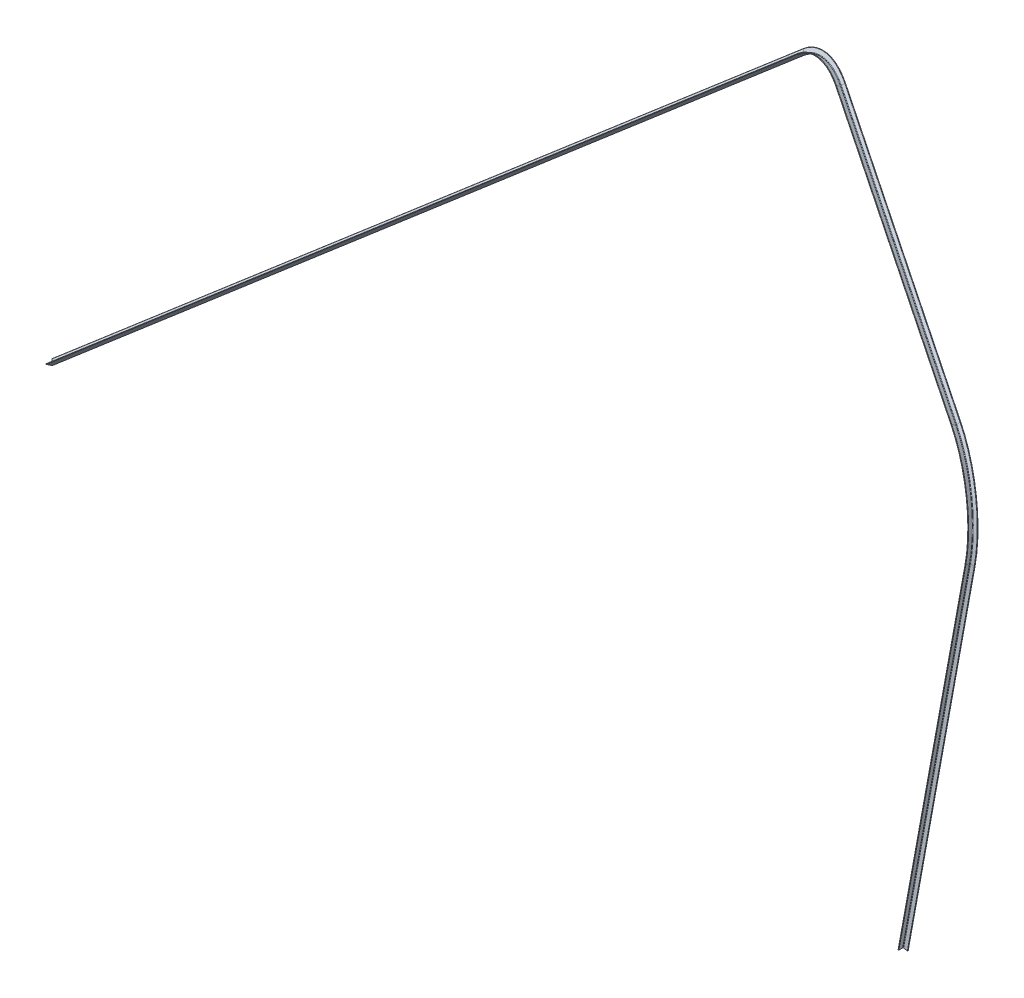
ISO-10303-21;
HEADER;
FILE_DESCRIPTION(('STEP AP214'),'2;1');
FILE_NAME('part.step','',(''),(''),'','','');
FILE_SCHEMA(('AUTOMOTIVE_DESIGN { 1 0 10303 214 1 1 1 1 }'));
ENDSEC;
DATA;
#1=APPLICATION_CONTEXT('core data for automotive mechanical design processes');
#2=APPLICATION_PROTOCOL_DEFINITION('international standard','automotive_design',2000,#1);
#3=PRODUCT_CONTEXT('',#1,'mechanical');
#4=PRODUCT('Part','Part','',(#3));
#5=PRODUCT_RELATED_PRODUCT_CATEGORY('part','',(#4));
#6=PRODUCT_DEFINITION_FORMATION('','',#4);
#7=PRODUCT_DEFINITION_CONTEXT('part definition',#1,'design');
#8=PRODUCT_DEFINITION('design','',#6,#7);
#9=PRODUCT_DEFINITION_SHAPE('','',#8);
#10=(LENGTH_UNIT() NAMED_UNIT(*) SI_UNIT(.MILLI.,.METRE.));
#11=(NAMED_UNIT(*) PLANE_ANGLE_UNIT() SI_UNIT($,.RADIAN.));
#12=(NAMED_UNIT(*) SI_UNIT($,.STERADIAN.) SOLID_ANGLE_UNIT());
#13=UNCERTAINTY_MEASURE_WITH_UNIT(LENGTH_MEASURE(1.E-05),#10,'distance_accuracy_value','');
#14=(GEOMETRIC_REPRESENTATION_CONTEXT(3) GLOBAL_UNCERTAINTY_ASSIGNED_CONTEXT((#13)) GLOBAL_UNIT_ASSIGNED_CONTEXT((#10,
#11,#12)) REPRESENTATION_CONTEXT('',''));
#15=CARTESIAN_POINT('',(0.,0.,0.));
#16=DIRECTION('',(0.,0.,1.));
#17=DIRECTION('',(1.,0.,0.));
#18=AXIS2_PLACEMENT_3D('',#15,#16,#17);
#19=CARTESIAN_POINT('',(2310.6269897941,5591.29434517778,-3397.12289864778));
#20=DIRECTION('',(0.506532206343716,-0.634988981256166,0.583278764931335));
#21=DIRECTION('',(0.,-0.676484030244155,-0.736457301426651));
#22=AXIS2_PLACEMENT_3D('',#19,#20,#21);
#23=PLANE('',#22);
#24=DIRECTION('',(-0.418650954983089,0.41025951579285,0.810196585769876));
#25=VECTOR('',#24,1.);
#26=CARTESIAN_POINT('',(-18525.1233839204,-12502.8674005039,-5001.18391064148));
#27=LINE('',#26,#25);
#28=CARTESIAN_POINT('',(-18525.1233839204,-12502.8674005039,-5001.18391064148));
#29=VERTEX_POINT('',#28);
#30=CARTESIAN_POINT('',(-18528.0539406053,-12499.9955838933,-4995.51253454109));
#31=VERTEX_POINT('',#30);
#32=EDGE_CURVE('E186',#29,#31,#27,.T.);
#33=ORIENTED_EDGE('',*,*,#32,.T.);
#34=DIRECTION('',(-0.75376156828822,-0.65458087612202,-0.0580290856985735));
#35=VECTOR('',#34,1.);
#36=CARTESIAN_POINT('',(2307.69643310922,5594.16616178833,-3391.45152254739));
#37=LINE('',#36,#35);
#38=CARTESIAN_POINT('',(2307.69643310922,5594.16616178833,-3391.45152254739));
#39=VERTEX_POINT('',#38);
#40=EDGE_CURVE('E11',#39,#31,#37,.T.);
#41=ORIENTED_EDGE('',*,*,#40,.F.);
#42=DIRECTION('',(-0.418650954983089,0.41025951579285,0.810196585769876));
#43=VECTOR('',#42,1.);
#44=CARTESIAN_POINT('',(2310.6269897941,5591.29434517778,-3397.12289864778));
#45=LINE('',#44,#43);
#46=CARTESIAN_POINT('',(2310.6269897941,5591.29434517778,-3397.12289864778));
#47=VERTEX_POINT('',#46);
#48=EDGE_CURVE('E246',#47,#39,#45,.T.);
#49=ORIENTED_EDGE('',*,*,#48,.F.);
#50=DIRECTION('',(-0.75376156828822,-0.65458087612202,-0.0580290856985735));
#51=VECTOR('',#50,1.);
#52=CARTESIAN_POINT('',(2310.6269897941,5591.29434517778,-3397.12289864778));
#53=LINE('',#52,#51);
#54=EDGE_CURVE('E202',#47,#29,#53,.T.);
#55=ORIENTED_EDGE('',*,*,#54,.T.);
#56=EDGE_LOOP('',(#33,#41,#49,#55));
#57=FACE_BOUND('',#56,.T.);
#58=ADVANCED_FACE('F37',(#57),#23,.F.);
#59=CARTESIAN_POINT('',(2311.24215855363,5589.72123891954,-3387.36857119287));
#60=DIRECTION('',(-0.75376156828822,-0.65458087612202,-0.0580290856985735));
#61=DIRECTION('',(0.655685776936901,-0.755033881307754,0.));
#62=AXIS2_PLACEMENT_3D('',#59,#60,#61);
#63=CYLINDRICAL_SURFACE('',#62,7.00000000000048);
#64=CARTESIAN_POINT('',(-18524.5082151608,-12504.4405067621,-4991.42958318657));
#65=DIRECTION('',(0.753761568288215,0.654580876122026,0.058029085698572));
#66=DIRECTION('',(0.504773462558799,-0.63326427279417,0.586668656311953));
#67=AXIS2_PLACEMENT_3D('',#64,#65,#66);
#68=CIRCLE('',#67,7.00000000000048);
#69=CARTESIAN_POINT('',(-18527.4387718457,-12501.5686901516,-4985.75820708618));
#70=VERTEX_POINT('',#69);
#71=EDGE_CURVE('E189',#31,#70,#68,.T.);
#72=ORIENTED_EDGE('',*,*,#71,.T.);
#73=DIRECTION('',(-0.75376156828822,-0.65458087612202,-0.0580290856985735));
#74=VECTOR('',#73,1.);
#75=CARTESIAN_POINT('',(2308.31160186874,5592.59305553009,-3381.69719509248));
#76=LINE('',#75,#74);
#77=CARTESIAN_POINT('',(2308.31160186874,5592.59305553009,-3381.69719509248));
#78=VERTEX_POINT('',#77);
#79=EDGE_CURVE('E45',#78,#70,#76,.T.);
#80=ORIENTED_EDGE('',*,*,#79,.F.);
#81=CARTESIAN_POINT('',(2311.24215855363,5589.72123891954,-3387.36857119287));
#82=DIRECTION('',(0.753761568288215,0.654580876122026,0.058029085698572));
#83=DIRECTION('',(0.504773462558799,-0.63326427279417,0.586668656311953));
#84=AXIS2_PLACEMENT_3D('',#81,#82,#83);
#85=CIRCLE('',#84,7.00000000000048);
#86=EDGE_CURVE('E98',#39,#78,#85,.T.);
#87=ORIENTED_EDGE('',*,*,#86,.F.);
#88=ORIENTED_EDGE('',*,*,#40,.T.);
#89=EDGE_LOOP('',(#72,#80,#87,#88));
#90=FACE_BOUND('',#89,.T.);
#91=ADVANCED_FACE('F585',(#90),#63,.T.);
#92=CARTESIAN_POINT('',(2308.31160186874,5592.59305553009,-3381.69719509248));
#93=DIRECTION('',(0.418650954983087,-0.410259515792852,-0.810196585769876));
#94=DIRECTION('',(-0.8884038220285,0.,-0.459062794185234));
#95=AXIS2_PLACEMENT_3D('',#92,#93,#94);
#96=PLANE('',#95);
#97=DIRECTION('',(0.50653220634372,-0.634988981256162,0.583278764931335));
#98=VECTOR('',#97,1.);
#99=CARTESIAN_POINT('',(-18527.4387718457,-12501.5686901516,-4985.75820708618));
#100=LINE('',#99,#98);
#101=CARTESIAN_POINT('',(-18479.3182122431,-12561.8926433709,-4930.34672441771));
#102=VERTEX_POINT('',#101);
#103=EDGE_CURVE('E191',#70,#102,#100,.T.);
#104=ORIENTED_EDGE('',*,*,#103,.T.);
#105=DIRECTION('',(-0.75376156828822,-0.65458087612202,-0.0580290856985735));
#106=VECTOR('',#105,1.);
#107=CARTESIAN_POINT('',(2356.4321614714,5532.26910231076,-3326.28571242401));
#108=LINE('',#107,#106);
#109=CARTESIAN_POINT('',(2356.4321614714,5532.26910231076,-3326.28571242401));
#110=VERTEX_POINT('',#109);
#111=EDGE_CURVE('E210',#110,#102,#108,.T.);
#112=ORIENTED_EDGE('',*,*,#111,.F.);
#113=DIRECTION('',(0.50653220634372,-0.634988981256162,0.583278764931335));
#114=VECTOR('',#113,1.);
#115=CARTESIAN_POINT('',(2308.31160186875,5592.59305553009,-3381.69719509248));
#116=LINE('',#115,#114);
#117=EDGE_CURVE('E218',#78,#110,#116,.T.);
#118=ORIENTED_EDGE('',*,*,#117,.F.);
#119=ORIENTED_EDGE('',*,*,#79,.T.);
#120=EDGE_LOOP('',(#104,#112,#118,#119));
#121=FACE_BOUND('',#120,.T.);
#122=ADVANCED_FACE('F216',(#121),#96,.F.);
#123=CARTESIAN_POINT('',(2350.57104810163,5538.01273553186,-3314.94296022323));
#124=DIRECTION('',(-0.75376156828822,-0.65458087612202,-0.0580290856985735));
#125=DIRECTION('',(0.655685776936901,-0.755033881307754,0.));
#126=AXIS2_PLACEMENT_3D('',#123,#124,#125);
#127=CYLINDRICAL_SURFACE('',#126,14.0000000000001);
#128=CARTESIAN_POINT('',(-18485.1793256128,-12556.1490101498,-4919.00397221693));
#129=DIRECTION('',(-0.753761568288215,-0.654580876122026,-0.058029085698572));
#130=DIRECTION('',(0.504773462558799,-0.63326427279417,0.586668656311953));
#131=AXIS2_PLACEMENT_3D('',#128,#129,#130);
#132=CIRCLE('',#131,14.0000000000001);
#133=CARTESIAN_POINT('',(-18478.087874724,-12565.0388558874,-4910.83806950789));
#134=VERTEX_POINT('',#133);
#135=EDGE_CURVE('E193',#102,#134,#132,.T.);
#136=ORIENTED_EDGE('',*,*,#135,.T.);
#137=DIRECTION('',(-0.75376156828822,-0.65458087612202,-0.0580290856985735));
#138=VECTOR('',#137,1.);
#139=CARTESIAN_POINT('',(2357.66249899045,5529.12288979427,-3306.77705751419));
#140=LINE('',#139,#138);
#141=CARTESIAN_POINT('',(2357.66249899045,5529.12288979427,-3306.77705751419));
#142=VERTEX_POINT('',#141);
#143=EDGE_CURVE('E207',#142,#134,#140,.T.);
#144=ORIENTED_EDGE('',*,*,#143,.F.);
#145=CARTESIAN_POINT('',(2350.57104810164,5538.01273553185,-3314.94296022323));
#146=DIRECTION('',(-0.753761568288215,-0.654580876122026,-0.058029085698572));
#147=DIRECTION('',(0.504773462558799,-0.63326427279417,0.586668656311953));
#148=AXIS2_PLACEMENT_3D('',#145,#146,#147);
#149=CIRCLE('',#148,14.0000000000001);
#150=EDGE_CURVE('E156',#110,#142,#149,.T.);
#151=ORIENTED_EDGE('',*,*,#150,.F.);
#152=ORIENTED_EDGE('',*,*,#111,.T.);
#153=EDGE_LOOP('',(#136,#144,#151,#152));
#154=FACE_BOUND('',#153,.T.);
#155=ADVANCED_FACE('F225',(#154),#127,.F.);
#156=CARTESIAN_POINT('',(2357.66249899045,5529.12288979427,-3306.77705751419));
#157=DIRECTION('',(0.506532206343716,-0.634988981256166,0.583278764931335));
#158=DIRECTION('',(0.,-0.676484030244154,-0.736457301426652));
#159=AXIS2_PLACEMENT_3D('',#156,#157,#158);
#160=PLANE('',#159);
#161=DIRECTION('',(-0.418650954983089,0.41025951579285,0.810196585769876));
#162=VECTOR('',#161,1.);
#163=CARTESIAN_POINT('',(-18478.087874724,-12565.0388558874,-4910.83806950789));
#164=LINE('',#163,#162);
#165=CARTESIAN_POINT('',(-18517.8597154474,-12526.0642018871,-4833.86939385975));
#166=VERTEX_POINT('',#165);
#167=EDGE_CURVE('E195',#134,#166,#164,.T.);
#168=ORIENTED_EDGE('',*,*,#167,.T.);
#169=DIRECTION('',(-0.75376156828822,-0.65458087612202,-0.0580290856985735));
#170=VECTOR('',#169,1.);
#171=CARTESIAN_POINT('',(2317.89065826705,5568.09754379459,-3229.80838186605));
#172=LINE('',#171,#170);
#173=CARTESIAN_POINT('',(2317.89065826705,5568.09754379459,-3229.80838186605));
#174=VERTEX_POINT('',#173);
#175=EDGE_CURVE('E127',#174,#166,#172,.T.);
#176=ORIENTED_EDGE('',*,*,#175,.F.);
#177=DIRECTION('',(-0.418650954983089,0.41025951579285,0.810196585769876));
#178=VECTOR('',#177,1.);
#179=CARTESIAN_POINT('',(2357.66249899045,5529.12288979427,-3306.77705751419));
#180=LINE('',#179,#178);
#181=EDGE_CURVE('E154',#142,#174,#180,.T.);
#182=ORIENTED_EDGE('',*,*,#181,.F.);
#183=ORIENTED_EDGE('',*,*,#143,.T.);
#184=EDGE_LOOP('',(#168,#176,#182,#183));
#185=FACE_BOUND('',#184,.T.);
#186=ADVANCED_FACE('F229',(#185),#160,.F.);
#187=CARTESIAN_POINT('',(2321.43638371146,5563.6526209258,-3225.72543051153));
#188=DIRECTION('',(-0.75376156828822,-0.65458087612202,-0.0580290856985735));
#189=DIRECTION('',(0.655685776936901,-0.755033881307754,0.));
#190=AXIS2_PLACEMENT_3D('',#187,#188,#189);
#191=CYLINDRICAL_SURFACE('',#190,7.00000000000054);
#192=CARTESIAN_POINT('',(-18514.313990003,-12530.5091247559,-4829.78644250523));
#193=DIRECTION('',(0.753761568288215,0.654580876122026,0.058029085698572));
#194=DIRECTION('',(-0.504773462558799,0.63326427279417,-0.586668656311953));
#195=AXIS2_PLACEMENT_3D('',#192,#193,#194);
#196=CIRCLE('',#195,7.00000000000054);
#197=CARTESIAN_POINT('',(-18517.2445466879,-12527.6373081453,-4824.11506640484));
#198=VERTEX_POINT('',#197);
#199=EDGE_CURVE('E124',#166,#198,#196,.T.);
#200=ORIENTED_EDGE('',*,*,#199,.T.);
#201=DIRECTION('',(-0.75376156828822,-0.65458087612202,-0.0580290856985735));
#202=VECTOR('',#201,1.);
#203=CARTESIAN_POINT('',(2318.50582702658,5566.52443753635,-3220.05405441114));
#204=LINE('',#203,#202);
#205=CARTESIAN_POINT('',(2318.50582702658,5566.52443753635,-3220.05405441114));
#206=VERTEX_POINT('',#205);
#207=EDGE_CURVE('E116',#206,#198,#204,.T.);
#208=ORIENTED_EDGE('',*,*,#207,.F.);
#209=CARTESIAN_POINT('',(2321.43638371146,5563.65262092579,-3225.72543051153));
#210=DIRECTION('',(0.753761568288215,0.654580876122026,0.058029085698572));
#211=DIRECTION('',(-0.504773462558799,0.63326427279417,-0.586668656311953));
#212=AXIS2_PLACEMENT_3D('',#209,#210,#211);
#213=CIRCLE('',#212,7.00000000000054);
#214=EDGE_CURVE('E121',#174,#206,#213,.T.);
#215=ORIENTED_EDGE('',*,*,#214,.F.);
#216=ORIENTED_EDGE('',*,*,#175,.T.);
#217=EDGE_LOOP('',(#200,#208,#215,#216));
#218=FACE_BOUND('',#217,.T.);
#219=ADVANCED_FACE('F118',(#218),#191,.T.);
#220=CARTESIAN_POINT('',(2318.50582702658,5566.52443753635,-3220.05405441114));
#221=DIRECTION('',(0.418650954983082,-0.410259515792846,-0.810196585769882));
#222=DIRECTION('',(-0.888403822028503,0.,-0.459062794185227));
#223=AXIS2_PLACEMENT_3D('',#220,#221,#222);
#224=PLANE('',#223);
#225=DIRECTION('',(0.506532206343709,-0.634988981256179,0.583278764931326));
#226=VECTOR('',#225,1.);
#227=CARTESIAN_POINT('',(-18517.2445466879,-12527.6373081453,-4824.11506640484));
#228=LINE('',#227,#226);
#229=CARTESIAN_POINT('',(-18513.6988212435,-12532.0822310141,-4820.03211505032));
#230=VERTEX_POINT('',#229);
#231=EDGE_CURVE('E198',#198,#230,#228,.T.);
#232=ORIENTED_EDGE('',*,*,#231,.T.);
#233=DIRECTION('',(-0.75376156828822,-0.65458087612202,-0.0580290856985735));
#234=VECTOR('',#233,1.);
#235=CARTESIAN_POINT('',(2322.05155247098,5562.07951466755,-3215.97110305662));
#236=LINE('',#235,#234);
#237=CARTESIAN_POINT('',(2322.05155247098,5562.07951466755,-3215.97110305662));
#238=VERTEX_POINT('',#237);
#239=EDGE_CURVE('E128',#238,#230,#236,.T.);
#240=ORIENTED_EDGE('',*,*,#239,.F.);
#241=DIRECTION('',(0.506532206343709,-0.634988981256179,0.583278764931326));
#242=VECTOR('',#241,1.);
#243=CARTESIAN_POINT('',(2318.50582702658,5566.52443753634,-3220.05405441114));
#244=LINE('',#243,#242);
#245=EDGE_CURVE('E131',#206,#238,#244,.T.);
#246=ORIENTED_EDGE('',*,*,#245,.F.);
#247=ORIENTED_EDGE('',*,*,#207,.T.);
#248=EDGE_LOOP('',(#232,#240,#246,#247));
#249=FACE_BOUND('',#248,.T.);
#250=ADVANCED_FACE('F133',(#249),#224,.F.);
#251=CARTESIAN_POINT('',(2376.47617661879,5508.74577761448,-3321.29665920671));
#252=DIRECTION('',(-0.506532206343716,0.634988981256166,-0.583278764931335));
#253=DIRECTION('',(0.,0.676484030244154,0.736457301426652));
#254=AXIS2_PLACEMENT_3D('',#251,#252,#253);
#255=PLANE('',#254);
#256=DIRECTION('',(0.41865095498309,-0.41025951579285,-0.810196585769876));
#257=VECTOR('',#256,1.);
#258=CARTESIAN_POINT('',(-18459.2741970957,-12585.4159680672,-4925.35767120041));
#259=LINE('',#258,#257);
#260=CARTESIAN_POINT('',(-18459.2741970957,-12585.4159680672,-4925.35767120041));
#261=VERTEX_POINT('',#260);
#262=EDGE_CURVE('E84',#230,#261,#259,.T.);
#263=ORIENTED_EDGE('',*,*,#262,.T.);
#264=DIRECTION('',(-0.75376156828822,-0.65458087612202,-0.0580290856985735));
#265=VECTOR('',#264,1.);
#266=CARTESIAN_POINT('',(2376.47617661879,5508.74577761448,-3321.29665920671));
#267=LINE('',#266,#265);
#268=CARTESIAN_POINT('',(2376.47617661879,5508.74577761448,-3321.29665920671));
#269=VERTEX_POINT('',#268);
#270=EDGE_CURVE('E53',#269,#261,#267,.T.);
#271=ORIENTED_EDGE('',*,*,#270,.F.);
#272=DIRECTION('',(0.41865095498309,-0.41025951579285,-0.810196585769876));
#273=VECTOR('',#272,1.);
#274=CARTESIAN_POINT('',(2376.47617661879,5508.74577761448,-3321.29665920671));
#275=LINE('',#274,#273);
#276=EDGE_CURVE('E136',#238,#269,#275,.T.);
#277=ORIENTED_EDGE('',*,*,#276,.F.);
#278=ORIENTED_EDGE('',*,*,#239,.T.);
#279=EDGE_LOOP('',(#263,#271,#277,#278));
#280=FACE_BOUND('',#279,.T.);
#281=ADVANCED_FACE('F575',(#280),#255,.F.);
#282=CARTESIAN_POINT('',(2310.6269897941,5591.29434517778,-3397.12289864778));
#283=DIRECTION('',(-0.418650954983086,0.410259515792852,0.810196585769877));
#284=DIRECTION('',(0.8884038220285,0.,0.459062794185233));
#285=AXIS2_PLACEMENT_3D('',#282,#283,#284);
#286=PLANE('',#285);
#287=DIRECTION('',(-0.506532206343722,0.634988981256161,-0.583278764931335));
#288=VECTOR('',#287,1.);
#289=CARTESIAN_POINT('',(-18525.1233839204,-12502.8674005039,-5001.18391064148));
#290=LINE('',#289,#288);
#291=EDGE_CURVE('E90',#261,#29,#290,.T.);
#292=ORIENTED_EDGE('',*,*,#291,.T.);
#293=ORIENTED_EDGE('',*,*,#54,.F.);
#294=DIRECTION('',(-0.506532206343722,0.634988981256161,-0.583278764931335));
#295=VECTOR('',#294,1.);
#296=CARTESIAN_POINT('',(2310.6269897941,5591.29434517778,-3397.12289864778));
#297=LINE('',#296,#295);
#298=EDGE_CURVE('E162',#269,#47,#297,.T.);
#299=ORIENTED_EDGE('',*,*,#298,.F.);
#300=ORIENTED_EDGE('',*,*,#270,.T.);
#301=EDGE_LOOP('',(#292,#293,#299,#300));
#302=FACE_BOUND('',#301,.T.);
#303=ADVANCED_FACE('F574',(#302),#286,.F.);
#304=CARTESIAN_POINT('',(-18524.5082151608,-12504.4405067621,-4991.42958318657));
#305=DIRECTION('',(-0.753761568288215,-0.654580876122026,-0.058029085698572));
#306=DIRECTION('',(0.504773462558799,-0.63326427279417,0.586668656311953));
#307=AXIS2_PLACEMENT_3D('',#304,#305,#306);
#308=PLANE('',#307);
#309=ORIENTED_EDGE('',*,*,#32,.F.);
#310=ORIENTED_EDGE('',*,*,#291,.F.);
#311=ORIENTED_EDGE('',*,*,#262,.F.);
#312=ORIENTED_EDGE('',*,*,#231,.F.);
#313=ORIENTED_EDGE('',*,*,#199,.F.);
#314=ORIENTED_EDGE('',*,*,#167,.F.);
#315=ORIENTED_EDGE('',*,*,#135,.F.);
#316=ORIENTED_EDGE('',*,*,#103,.F.);
#317=ORIENTED_EDGE('',*,*,#71,.F.);
#318=EDGE_LOOP('',(#309,#310,#311,#312,#313,#314,#315,#316,#317));
#319=FACE_BOUND('',#318,.T.);
#320=ADVANCED_FACE('F222',(#319),#308,.T.);
#321=CARTESIAN_POINT('',(3106.22054861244,4626.92118473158,-2853.04436839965));
#322=DIRECTION('',(-0.302250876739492,0.266923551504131,0.91509356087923));
#323=DIRECTION('',(0.949545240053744,0.,0.313630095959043));
#324=AXIS2_PLACEMENT_3D('',#321,#322,#323);
#325=CONICAL_SURFACE('',#324,1363.45375810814,0.212762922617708);
#326=CARTESIAN_POINT('',(3106.22054861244,4626.92118473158,-2853.04436839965));
#327=DIRECTION('',(-0.302250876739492,0.266923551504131,0.91509356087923));
#328=DIRECTION('',(0.949545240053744,0.,0.313630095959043));
#329=AXIS2_PLACEMENT_3D('',#326,#327,#328);
#330=CIRCLE('',#329,1363.45375810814);
#331=CARTESIAN_POINT('',(3802.82671329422,5793.79078006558,-2963.32287633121));
#332=VERTEX_POINT('',#331);
#333=EDGE_CURVE('E183',#332,#47,#330,.T.);
#334=ORIENTED_EDGE('',*,*,#333,.T.);
#335=ORIENTED_EDGE('',*,*,#48,.T.);
#336=CARTESIAN_POINT('',(3104.15250018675,4628.74751799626,-2846.78315315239));
#337=DIRECTION('',(-0.302250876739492,0.266923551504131,0.91509356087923));
#338=DIRECTION('',(0.949545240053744,0.,0.313630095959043));
#339=AXIS2_PLACEMENT_3D('',#336,#337,#338);
#340=CIRCLE('',#339,1364.93188737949);
#341=CARTESIAN_POINT('',(3801.51386023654,5796.8821244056,-2957.18121474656));
#342=VERTEX_POINT('',#341);
#343=EDGE_CURVE('E165',#342,#39,#340,.T.);
#344=ORIENTED_EDGE('',*,*,#343,.F.);
#345=DIRECTION('',(-0.187550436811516,0.441620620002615,0.877380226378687));
#346=VECTOR('',#345,1.);
#347=CARTESIAN_POINT('',(3802.82671329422,5793.79078006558,-2963.32287633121));
#348=LINE('',#347,#346);
#349=EDGE_CURVE('E294',#332,#342,#348,.T.);
#350=ORIENTED_EDGE('',*,*,#349,.F.);
#351=EDGE_LOOP('',(#334,#335,#344,#350));
#352=FACE_BOUND('',#351,.T.);
#353=ADVANCED_FACE('F572',(#352),#325,.T.);
#354=CARTESIAN_POINT('',(3097.92346820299,4634.24849571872,-2827.92416051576));
#355=DIRECTION('',(0.302250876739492,-0.266923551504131,-0.91509356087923));
#356=DIRECTION('',(-0.949545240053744,0.,-0.313630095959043));
#357=AXIS2_PLACEMENT_3D('',#354,#355,#356);
#358=CONICAL_SURFACE('',#357,1236.38509900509,1.35803340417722);
#359=CARTESIAN_POINT('',(3097.92346820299,4634.24849571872,-2827.92416051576));
#360=DIRECTION('',(-0.302250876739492,0.266923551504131,0.91509356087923));
#361=DIRECTION('',(0.949545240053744,0.,0.313630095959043));
#362=AXIS2_PLACEMENT_3D('',#359,#360,#361);
#363=CIRCLE('',#362,1236.38509900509);
#364=CARTESIAN_POINT('',(3729.60861099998,5692.37032168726,-2927.9251346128));
#365=VERTEX_POINT('',#364);
#366=EDGE_CURVE('E180',#365,#269,#363,.T.);
#367=ORIENTED_EDGE('',*,*,#366,.T.);
#368=ORIENTED_EDGE('',*,*,#298,.T.);
#369=ORIENTED_EDGE('',*,*,#333,.F.);
#370=DIRECTION('',(0.563216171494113,0.780157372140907,-0.272290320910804));
#371=VECTOR('',#370,1.);
#372=CARTESIAN_POINT('',(3802.82671329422,5793.79078006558,-2963.32287633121));
#373=LINE('',#372,#371);
#374=EDGE_CURVE('E276',#365,#332,#373,.T.);
#375=ORIENTED_EDGE('',*,*,#374,.F.);
#376=EDGE_LOOP('',(#367,#368,#369,#375));
#377=FACE_BOUND('',#376,.T.);
#378=ADVANCED_FACE('F529',(#377),#358,.F.);
#379=CARTESIAN_POINT('',(3059.51685458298,4668.16611349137,-2711.644448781));
#380=DIRECTION('',(-0.302250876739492,0.266923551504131,0.91509356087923));
#381=DIRECTION('',(0.949545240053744,0.,0.313630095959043));
#382=AXIS2_PLACEMENT_3D('',#379,#380,#381);
#383=CONICAL_SURFACE('',#382,1263.83607118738,0.212762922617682);
#384=CARTESIAN_POINT('',(3059.51685458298,4668.16611349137,-2711.644448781));
#385=DIRECTION('',(-0.302250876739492,0.266923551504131,0.91509356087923));
#386=DIRECTION('',(0.949545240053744,0.,0.313630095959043));
#387=AXIS2_PLACEMENT_3D('',#384,#385,#386);
#388=CIRCLE('',#387,1263.83607118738);
#389=CARTESIAN_POINT('',(3705.22705421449,5749.7810022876,-2813.86570518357));
#390=VERTEX_POINT('',#389);
#391=EDGE_CURVE('E148',#390,#238,#388,.T.);
#392=ORIENTED_EDGE('',*,*,#391,.T.);
#393=ORIENTED_EDGE('',*,*,#276,.T.);
#394=ORIENTED_EDGE('',*,*,#366,.F.);
#395=DIRECTION('',(0.187550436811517,-0.441620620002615,-0.877380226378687));
#396=VECTOR('',#395,1.);
#397=CARTESIAN_POINT('',(3729.60861099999,5692.37032168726,-2927.9251346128));
#398=LINE('',#397,#396);
#399=EDGE_CURVE('E279',#390,#365,#398,.T.);
#400=ORIENTED_EDGE('',*,*,#399,.F.);
#401=EDGE_LOOP('',(#392,#393,#394,#400));
#402=FACE_BOUND('',#401,.T.);
#403=ADVANCED_FACE('F526',(#402),#383,.F.);
#404=CARTESIAN_POINT('',(3059.96362045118,4667.77156597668,-2712.99707535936));
#405=DIRECTION('',(0.302250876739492,-0.266923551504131,-0.91509356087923));
#406=DIRECTION('',(-0.949545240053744,0.,-0.313630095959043));
#407=AXIS2_PLACEMENT_3D('',#404,#405,#406);
#408=CONICAL_SURFACE('',#407,1270.67822975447,1.35803340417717);
#409=CARTESIAN_POINT('',(3059.96362045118,4667.77156597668,-2712.99707535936));
#410=DIRECTION('',(-0.302250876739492,0.266923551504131,0.91509356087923));
#411=DIRECTION('',(0.949545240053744,0.,0.313630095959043));
#412=AXIS2_PLACEMENT_3D('',#409,#410,#411);
#413=CIRCLE('',#412,1270.67822975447);
#414=CARTESIAN_POINT('',(3709.16956741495,5755.24210389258,-2815.77173742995));
#415=VERTEX_POINT('',#414);
#416=EDGE_CURVE('E140',#415,#206,#413,.T.);
#417=ORIENTED_EDGE('',*,*,#416,.T.);
#418=ORIENTED_EDGE('',*,*,#245,.T.);
#419=ORIENTED_EDGE('',*,*,#391,.F.);
#420=DIRECTION('',(-0.56321617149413,-0.780157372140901,0.272290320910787));
#421=VECTOR('',#420,1.);
#422=CARTESIAN_POINT('',(3709.16956741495,5755.24210389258,-2815.77173742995));
#423=LINE('',#422,#421);
#424=EDGE_CURVE('E144',#415,#390,#423,.T.);
#425=ORIENTED_EDGE('',*,*,#424,.F.);
#426=EDGE_LOOP('',(#417,#418,#419,#425));
#427=FACE_BOUND('',#426,.T.);
#428=ADVANCED_FACE('F141',(#427),#408,.T.);
#429=CARTESIAN_POINT('',(3062.03166887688,4665.945232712,-2719.25829060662));
#430=DIRECTION('',(-0.302250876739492,0.266923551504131,0.91509356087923));
#431=DIRECTION('',(0.949545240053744,0.,0.313630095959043));
#432=AXIS2_PLACEMENT_3D('',#429,#430,#431);
#433=TOROIDAL_SURFACE('',#432,1269.20010048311,7.00000000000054);
#434=CARTESIAN_POINT('',(3062.47843474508,4665.55068519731,-2720.61091718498));
#435=DIRECTION('',(-0.302250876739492,0.266923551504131,0.91509356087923));
#436=DIRECTION('',(0.949545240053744,0.,0.313630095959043));
#437=AXIS2_PLACEMENT_3D('',#434,#435,#436);
#438=CIRCLE('',#437,1276.0422590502);
#439=CARTESIAN_POINT('',(3714.42493367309,5757.61186115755,-2823.81943126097));
#440=VERTEX_POINT('',#439);
#441=EDGE_CURVE('E149',#440,#174,#438,.T.);
#442=ORIENTED_EDGE('',*,*,#441,.T.);
#443=ORIENTED_EDGE('',*,*,#214,.T.);
#444=ORIENTED_EDGE('',*,*,#416,.F.);
#445=CARTESIAN_POINT('',(3710.48242047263,5752.15075955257,-2821.9133990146));
#446=DIRECTION('',(0.80474367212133,-0.443086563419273,0.395046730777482));
#447=DIRECTION('',(0.563997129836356,0.778299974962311,-0.275964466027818));
#448=AXIS2_PLACEMENT_3D('',#445,#446,#447);
#449=CIRCLE('',#448,7.00000000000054);
#450=EDGE_CURVE('E283',#440,#415,#449,.T.);
#451=ORIENTED_EDGE('',*,*,#450,.F.);
#452=EDGE_LOOP('',(#442,#443,#444,#451));
#453=FACE_BOUND('',#452,.T.);
#454=ADVANCED_FACE('F151',(#453),#433,.T.);
#455=CARTESIAN_POINT('',(3090.54480623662,4640.76473374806,-2805.58455268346));
#456=DIRECTION('',(-0.302250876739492,0.266923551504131,0.91509356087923));
#457=DIRECTION('',(0.949545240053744,0.,0.313630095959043));
#458=AXIS2_PLACEMENT_3D('',#455,#456,#457);
#459=CONICAL_SURFACE('',#458,1255.98193322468,0.212762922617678);
#460=CARTESIAN_POINT('',(3090.54480623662,4640.76473374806,-2805.58455268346));
#461=DIRECTION('',(-0.302250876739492,0.266923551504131,0.91509356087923));
#462=DIRECTION('',(0.949545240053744,0.,0.313630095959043));
#463=AXIS2_PLACEMENT_3D('',#460,#461,#462);
#464=CIRCLE('',#463,1255.98193322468);
#465=CARTESIAN_POINT('',(3732.24222517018,5715.65790225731,-2907.17055276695));
#466=VERTEX_POINT('',#465);
#467=EDGE_CURVE('E174',#466,#142,#464,.T.);
#468=ORIENTED_EDGE('',*,*,#467,.T.);
#469=ORIENTED_EDGE('',*,*,#181,.T.);
#470=ORIENTED_EDGE('',*,*,#441,.F.);
#471=DIRECTION('',(-0.187550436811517,0.441620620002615,0.877380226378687));
#472=VECTOR('',#471,1.);
#473=CARTESIAN_POINT('',(3732.24222517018,5715.65790225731,-2907.17055276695));
#474=LINE('',#473,#472);
#475=EDGE_CURVE('E237',#466,#440,#474,.T.);
#476=ORIENTED_EDGE('',*,*,#475,.F.);
#477=EDGE_LOOP('',(#468,#469,#470,#476));
#478=FACE_BOUND('',#477,.T.);
#479=ADVANCED_FACE('F234',(#478),#459,.T.);
#480=CARTESIAN_POINT('',(3091.43833797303,4639.97563871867,-2808.28980584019));
#481=DIRECTION('',(-0.302250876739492,0.266923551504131,0.91509356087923));
#482=DIRECTION('',(0.949545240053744,0.,0.313630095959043));
#483=AXIS2_PLACEMENT_3D('',#480,#481,#482);
#484=TOROIDAL_SURFACE('',#483,1269.66625035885,14.0000000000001);
#485=CARTESIAN_POINT('',(3095.57443482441,4636.32297218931,-2820.8122363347));
#486=DIRECTION('',(-0.302250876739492,0.266923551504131,0.91509356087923));
#487=DIRECTION('',(0.949545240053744,0.,0.313630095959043));
#488=AXIS2_PLACEMENT_3D('',#485,#486,#487);
#489=CIRCLE('',#488,1266.70999181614);
#490=CARTESIAN_POINT('',(3742.75295768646,5720.39741678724,-2923.265940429));
#491=VERTEX_POINT('',#490);
#492=EDGE_CURVE('E171',#491,#110,#489,.T.);
#493=ORIENTED_EDGE('',*,*,#492,.T.);
#494=ORIENTED_EDGE('',*,*,#150,.T.);
#495=ORIENTED_EDGE('',*,*,#467,.F.);
#496=CARTESIAN_POINT('',(3740.1272515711,5726.58010546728,-2910.9826172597));
#497=DIRECTION('',(-0.80474367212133,0.443086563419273,-0.395046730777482));
#498=DIRECTION('',(-0.563997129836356,-0.778299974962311,0.275964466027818));
#499=AXIS2_PLACEMENT_3D('',#496,#497,#498);
#500=CIRCLE('',#499,14.0000000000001);
#501=EDGE_CURVE('E286',#491,#466,#500,.T.);
#502=ORIENTED_EDGE('',*,*,#501,.F.);
#503=EDGE_LOOP('',(#493,#494,#495,#502));
#504=FACE_BOUND('',#503,.T.);
#505=ADVANCED_FACE('F241',(#504),#484,.F.);
#506=CARTESIAN_POINT('',(3101.63768589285,4630.96839877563,-2839.16931132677));
#507=DIRECTION('',(0.302250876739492,-0.266923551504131,-0.91509356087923));
#508=DIRECTION('',(-0.949545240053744,0.,-0.313630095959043));
#509=AXIS2_PLACEMENT_3D('',#506,#507,#508);
#510=CONICAL_SURFACE('',#509,1359.56785808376,1.35803340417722);
#511=CARTESIAN_POINT('',(3101.63768589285,4630.96839877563,-2839.16931132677));
#512=DIRECTION('',(-0.302250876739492,0.266923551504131,0.91509356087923));
#513=DIRECTION('',(0.949545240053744,0.,0.313630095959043));
#514=AXIS2_PLACEMENT_3D('',#511,#512,#513);
#515=CIRCLE('',#514,1359.56785808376);
#516=CARTESIAN_POINT('',(3796.2584939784,5794.51236714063,-2949.13352091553));
#517=VERTEX_POINT('',#516);
#518=EDGE_CURVE('E168',#517,#78,#515,.T.);
#519=ORIENTED_EDGE('',*,*,#518,.T.);
#520=ORIENTED_EDGE('',*,*,#117,.T.);
#521=ORIENTED_EDGE('',*,*,#492,.F.);
#522=DIRECTION('',(-0.563216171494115,-0.780157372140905,0.272290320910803));
#523=VECTOR('',#522,1.);
#524=CARTESIAN_POINT('',(3796.2584939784,5794.51236714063,-2949.13352091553));
#525=LINE('',#524,#523);
#526=EDGE_CURVE('E288',#517,#491,#525,.T.);
#527=ORIENTED_EDGE('',*,*,#526,.F.);
#528=EDGE_LOOP('',(#519,#520,#521,#527));
#529=FACE_BOUND('',#528,.T.);
#530=ADVANCED_FACE('F564',(#529),#510,.T.);
#531=CARTESIAN_POINT('',(3103.70573431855,4629.14206551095,-2845.43052657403));
#532=DIRECTION('',(-0.302250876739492,0.266923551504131,0.91509356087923));
#533=DIRECTION('',(0.949545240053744,0.,0.313630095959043));
#534=AXIS2_PLACEMENT_3D('',#531,#532,#533);
#535=TOROIDAL_SURFACE('',#534,1358.0897288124,7.00000000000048);
#536=CARTESIAN_POINT('',(3797.57134703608,5791.42102280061,-2955.27518250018));
#537=DIRECTION('',(0.80474367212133,-0.443086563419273,0.395046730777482));
#538=DIRECTION('',(-0.563997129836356,-0.778299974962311,0.275964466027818));
#539=AXIS2_PLACEMENT_3D('',#536,#537,#538);
#540=CIRCLE('',#539,7.00000000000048);
#541=EDGE_CURVE('E291',#342,#517,#540,.T.);
#542=ORIENTED_EDGE('',*,*,#541,.F.);
#543=ORIENTED_EDGE('',*,*,#343,.T.);
#544=ORIENTED_EDGE('',*,*,#86,.T.);
#545=ORIENTED_EDGE('',*,*,#518,.F.);
#546=EDGE_LOOP('',(#542,#543,#544,#545));
#547=FACE_BOUND('',#546,.T.);
#548=ADVANCED_FACE('F570',(#547),#535,.T.);
#549=CARTESIAN_POINT('',(9598.22905154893,2602.88043849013,-118.373824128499));
#550=DIRECTION('',(-0.56321617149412,-0.780157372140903,0.272290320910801));
#551=DIRECTION('',(0.810793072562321,-0.58533289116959,0.));
#552=AXIS2_PLACEMENT_3D('',#549,#550,#551);
#553=PLANE('',#552);
#554=ORIENTED_EDGE('',*,*,#349,.T.);
#555=DIRECTION('',(-0.804743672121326,0.443086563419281,-0.395046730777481));
#556=VECTOR('',#555,1.);
#557=CARTESIAN_POINT('',(9596.91619849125,2605.97178283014,-112.232162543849));
#558=LINE('',#557,#556);
#559=CARTESIAN_POINT('',(9596.91619849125,2605.97178283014,-112.232162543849));
#560=VERTEX_POINT('',#559);
#561=EDGE_CURVE('E249',#560,#342,#558,.T.);
#562=ORIENTED_EDGE('',*,*,#561,.F.);
#563=DIRECTION('',(-0.187550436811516,0.441620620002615,0.877380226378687));
#564=VECTOR('',#563,1.);
#565=CARTESIAN_POINT('',(9598.22905154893,2602.88043849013,-118.373824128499));
#566=LINE('',#565,#564);
#567=CARTESIAN_POINT('',(9598.22905154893,2602.88043849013,-118.373824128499));
#568=VERTEX_POINT('',#567);
#569=EDGE_CURVE('E348',#568,#560,#566,.T.);
#570=ORIENTED_EDGE('',*,*,#569,.F.);
#571=DIRECTION('',(-0.804743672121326,0.443086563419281,-0.395046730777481));
#572=VECTOR('',#571,1.);
#573=CARTESIAN_POINT('',(9598.22905154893,2602.88043849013,-118.373824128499));
#574=LINE('',#573,#572);
#575=EDGE_CURVE('E273',#568,#332,#574,.T.);
#576=ORIENTED_EDGE('',*,*,#575,.T.);
#577=EDGE_LOOP('',(#554,#562,#570,#576));
#578=FACE_BOUND('',#577,.T.);
#579=ADVANCED_FACE('F710',(#578),#553,.F.);
#580=CARTESIAN_POINT('',(9592.97368529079,2600.51068122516,-110.326130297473));
#581=DIRECTION('',(-0.804743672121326,0.443086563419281,-0.395046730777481));
#582=DIRECTION('',(-0.48231779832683,-0.875996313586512,0.));
#583=AXIS2_PLACEMENT_3D('',#580,#581,#582);
#584=CYLINDRICAL_SURFACE('',#583,7.00000000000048);
#585=ORIENTED_EDGE('',*,*,#541,.T.);
#586=DIRECTION('',(-0.804743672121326,0.443086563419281,-0.395046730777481));
#587=VECTOR('',#586,1.);
#588=CARTESIAN_POINT('',(9591.66083223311,2603.60202556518,-104.184468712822));
#589=LINE('',#588,#587);
#590=CARTESIAN_POINT('',(9591.66083223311,2603.60202556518,-104.184468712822));
#591=VERTEX_POINT('',#590);
#592=EDGE_CURVE('E252',#591,#517,#589,.T.);
#593=ORIENTED_EDGE('',*,*,#592,.F.);
#594=CARTESIAN_POINT('',(9592.97368529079,2600.51068122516,-110.326130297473));
#595=DIRECTION('',(0.80474367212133,-0.443086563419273,0.395046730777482));
#596=DIRECTION('',(-0.563997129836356,-0.778299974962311,0.275964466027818));
#597=AXIS2_PLACEMENT_3D('',#594,#595,#596);
#598=CIRCLE('',#597,7.00000000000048);
#599=EDGE_CURVE('E345',#560,#591,#598,.T.);
#600=ORIENTED_EDGE('',*,*,#599,.F.);
#601=ORIENTED_EDGE('',*,*,#561,.T.);
#602=EDGE_LOOP('',(#585,#593,#600,#601));
#603=FACE_BOUND('',#602,.T.);
#604=ADVANCED_FACE('F567',(#603),#584,.T.);
#605=CARTESIAN_POINT('',(9591.66083223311,2603.60202556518,-104.184468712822));
#606=DIRECTION('',(0.187550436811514,-0.441620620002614,-0.877380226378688));
#607=DIRECTION('',(0.,0.893230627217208,-0.449598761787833));
#608=AXIS2_PLACEMENT_3D('',#605,#606,#607);
#609=PLANE('',#608);
#610=ORIENTED_EDGE('',*,*,#526,.T.);
#611=DIRECTION('',(-0.804743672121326,0.443086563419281,-0.395046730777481));
#612=VECTOR('',#611,1.);
#613=CARTESIAN_POINT('',(9538.15529594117,2529.48707521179,-78.3168882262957));
#614=LINE('',#613,#612);
#615=CARTESIAN_POINT('',(9538.15529594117,2529.48707521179,-78.3168882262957));
#616=VERTEX_POINT('',#615);
#617=EDGE_CURVE('E255',#616,#491,#614,.T.);
#618=ORIENTED_EDGE('',*,*,#617,.F.);
#619=DIRECTION('',(-0.563216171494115,-0.780157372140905,0.272290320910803));
#620=VECTOR('',#619,1.);
#621=CARTESIAN_POINT('',(9591.66083223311,2603.60202556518,-104.184468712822));
#622=LINE('',#621,#620);
#623=EDGE_CURVE('E342',#591,#616,#622,.T.);
#624=ORIENTED_EDGE('',*,*,#623,.F.);
#625=ORIENTED_EDGE('',*,*,#592,.T.);
#626=EDGE_LOOP('',(#610,#618,#624,#625));
#627=FACE_BOUND('',#626,.T.);
#628=ADVANCED_FACE('F561',(#627),#609,.F.);
#629=CARTESIAN_POINT('',(9535.52958982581,2535.66976389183,-66.0335650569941));
#630=DIRECTION('',(-0.804743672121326,0.443086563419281,-0.395046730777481));
#631=DIRECTION('',(-0.48231779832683,-0.875996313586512,0.));
#632=AXIS2_PLACEMENT_3D('',#629,#630,#631);
#633=CYLINDRICAL_SURFACE('',#632,14.0000000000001);
#634=ORIENTED_EDGE('',*,*,#501,.T.);
#635=DIRECTION('',(-0.804743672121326,0.443086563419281,-0.395046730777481));
#636=VECTOR('',#635,1.);
#637=CARTESIAN_POINT('',(9527.64456342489,2524.74756068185,-62.2215005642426));
#638=LINE('',#637,#636);
#639=CARTESIAN_POINT('',(9527.64456342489,2524.74756068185,-62.2215005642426));
#640=VERTEX_POINT('',#639);
#641=EDGE_CURVE('E258',#640,#466,#638,.T.);
#642=ORIENTED_EDGE('',*,*,#641,.F.);
#643=CARTESIAN_POINT('',(9535.52958982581,2535.66976389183,-66.0335650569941));
#644=DIRECTION('',(-0.80474367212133,0.443086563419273,-0.395046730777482));
#645=DIRECTION('',(-0.563997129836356,-0.778299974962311,0.275964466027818));
#646=AXIS2_PLACEMENT_3D('',#643,#644,#645);
#647=CIRCLE('',#646,14.0000000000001);
#648=EDGE_CURVE('E339',#616,#640,#647,.T.);
#649=ORIENTED_EDGE('',*,*,#648,.F.);
#650=ORIENTED_EDGE('',*,*,#617,.T.);
#651=EDGE_LOOP('',(#634,#642,#649,#650));
#652=FACE_BOUND('',#651,.T.);
#653=ADVANCED_FACE('F558',(#652),#633,.F.);
#654=CARTESIAN_POINT('',(9527.64456342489,2524.74756068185,-62.2215005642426));
#655=DIRECTION('',(-0.56321617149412,-0.780157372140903,0.272290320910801));
#656=DIRECTION('',(0.810793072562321,-0.58533289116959,0.));
#657=AXIS2_PLACEMENT_3D('',#654,#655,#656);
#658=PLANE('',#657);
#659=ORIENTED_EDGE('',*,*,#475,.T.);
#660=DIRECTION('',(-0.804743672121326,0.443086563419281,-0.395046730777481));
#661=VECTOR('',#660,1.);
#662=CARTESIAN_POINT('',(9509.8272719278,2566.7015195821,21.1296209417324));
#663=LINE('',#662,#661);
#664=CARTESIAN_POINT('',(9509.8272719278,2566.7015195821,21.1296209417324));
#665=VERTEX_POINT('',#664);
#666=EDGE_CURVE('E261',#665,#440,#663,.T.);
#667=ORIENTED_EDGE('',*,*,#666,.F.);
#668=DIRECTION('',(-0.187550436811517,0.441620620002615,0.877380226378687));
#669=VECTOR('',#668,1.);
#670=CARTESIAN_POINT('',(9527.64456342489,2524.74756068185,-62.2215005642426));
#671=LINE('',#670,#669);
#672=EDGE_CURVE('E336',#640,#665,#671,.T.);
#673=ORIENTED_EDGE('',*,*,#672,.F.);
#674=ORIENTED_EDGE('',*,*,#641,.T.);
#675=EDGE_LOOP('',(#659,#667,#673,#674));
#676=FACE_BOUND('',#675,.T.);
#677=ADVANCED_FACE('F554',(#676),#658,.F.);
#678=CARTESIAN_POINT('',(9505.88475872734,2561.24041797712,23.0356531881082));
#679=DIRECTION('',(-0.804743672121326,0.443086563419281,-0.395046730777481));
#680=DIRECTION('',(-0.48231779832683,-0.875996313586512,0.));
#681=AXIS2_PLACEMENT_3D('',#678,#679,#680);
#682=CYLINDRICAL_SURFACE('',#681,7.00000000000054);
#683=ORIENTED_EDGE('',*,*,#450,.T.);
#684=DIRECTION('',(-0.804743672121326,0.443086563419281,-0.395046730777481));
#685=VECTOR('',#684,1.);
#686=CARTESIAN_POINT('',(9504.57190566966,2564.33176231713,29.1773147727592));
#687=LINE('',#686,#685);
#688=CARTESIAN_POINT('',(9504.57190566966,2564.33176231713,29.1773147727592));
#689=VERTEX_POINT('',#688);
#690=EDGE_CURVE('E264',#689,#415,#687,.T.);
#691=ORIENTED_EDGE('',*,*,#690,.F.);
#692=CARTESIAN_POINT('',(9505.88475872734,2561.24041797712,23.0356531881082));
#693=DIRECTION('',(0.80474367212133,-0.443086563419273,0.395046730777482));
#694=DIRECTION('',(0.563997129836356,0.778299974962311,-0.275964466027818));
#695=AXIS2_PLACEMENT_3D('',#692,#693,#694);
#696=CIRCLE('',#695,7.00000000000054);
#697=EDGE_CURVE('E333',#665,#689,#696,.T.);
#698=ORIENTED_EDGE('',*,*,#697,.F.);
#699=ORIENTED_EDGE('',*,*,#666,.T.);
#700=EDGE_LOOP('',(#683,#691,#698,#699));
#701=FACE_BOUND('',#700,.T.);
#702=ADVANCED_FACE('F552',(#701),#682,.T.);
#703=CARTESIAN_POINT('',(9504.57190566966,2564.33176231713,29.1773147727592));
#704=DIRECTION('',(0.18755043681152,-0.441620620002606,-0.87738022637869));
#705=DIRECTION('',(0.,0.893230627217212,-0.449598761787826));
#706=AXIS2_PLACEMENT_3D('',#703,#704,#705);
#707=PLANE('',#706);
#708=ORIENTED_EDGE('',*,*,#424,.T.);
#709=DIRECTION('',(-0.804743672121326,0.443086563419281,-0.395046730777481));
#710=VECTOR('',#709,1.);
#711=CARTESIAN_POINT('',(9500.6293924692,2558.87066071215,31.0833470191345));
#712=LINE('',#711,#710);
#713=CARTESIAN_POINT('',(9500.6293924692,2558.87066071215,31.0833470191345));
#714=VERTEX_POINT('',#713);
#715=EDGE_CURVE('E267',#714,#390,#712,.T.);
#716=ORIENTED_EDGE('',*,*,#715,.F.);
#717=DIRECTION('',(-0.56321617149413,-0.780157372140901,0.272290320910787));
#718=VECTOR('',#717,1.);
#719=CARTESIAN_POINT('',(9504.57190566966,2564.33176231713,29.1773147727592));
#720=LINE('',#719,#718);
#721=EDGE_CURVE('E330',#689,#714,#720,.T.);
#722=ORIENTED_EDGE('',*,*,#721,.F.);
#723=ORIENTED_EDGE('',*,*,#690,.T.);
#724=EDGE_LOOP('',(#708,#716,#722,#723));
#725=FACE_BOUND('',#724,.T.);
#726=ADVANCED_FACE('F549',(#725),#707,.F.);
#727=CARTESIAN_POINT('',(9525.0109492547,2501.45998011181,-82.9760824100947));
#728=DIRECTION('',(0.56321617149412,0.780157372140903,-0.272290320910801));
#729=DIRECTION('',(-0.810793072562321,0.58533289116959,0.));
#730=AXIS2_PLACEMENT_3D('',#727,#728,#729);
#731=PLANE('',#730);
#732=ORIENTED_EDGE('',*,*,#399,.T.);
#733=DIRECTION('',(-0.804743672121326,0.443086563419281,-0.395046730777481));
#734=VECTOR('',#733,1.);
#735=CARTESIAN_POINT('',(9525.0109492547,2501.45998011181,-82.9760824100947));
#736=LINE('',#735,#734);
#737=CARTESIAN_POINT('',(9525.0109492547,2501.45998011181,-82.9760824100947));
#738=VERTEX_POINT('',#737);
#739=EDGE_CURVE('E270',#738,#365,#736,.T.);
#740=ORIENTED_EDGE('',*,*,#739,.F.);
#741=DIRECTION('',(0.187550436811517,-0.441620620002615,-0.877380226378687));
#742=VECTOR('',#741,1.);
#743=CARTESIAN_POINT('',(9525.0109492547,2501.45998011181,-82.9760824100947));
#744=LINE('',#743,#742);
#745=EDGE_CURVE('E327',#714,#738,#744,.T.);
#746=ORIENTED_EDGE('',*,*,#745,.F.);
#747=ORIENTED_EDGE('',*,*,#715,.T.);
#748=EDGE_LOOP('',(#732,#740,#746,#747));
#749=FACE_BOUND('',#748,.T.);
#750=ADVANCED_FACE('F533',(#749),#731,.F.);
#751=CARTESIAN_POINT('',(9598.22905154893,2602.88043849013,-118.373824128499));
#752=DIRECTION('',(-0.187550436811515,0.441620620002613,0.877380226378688));
#753=DIRECTION('',(0.,-0.893230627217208,0.449598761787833));
#754=AXIS2_PLACEMENT_3D('',#751,#752,#753);
#755=PLANE('',#754);
#756=ORIENTED_EDGE('',*,*,#374,.T.);
#757=ORIENTED_EDGE('',*,*,#575,.F.);
#758=DIRECTION('',(0.563216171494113,0.780157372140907,-0.272290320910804));
#759=VECTOR('',#758,1.);
#760=CARTESIAN_POINT('',(9598.22905154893,2602.88043849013,-118.373824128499));
#761=LINE('',#760,#759);
#762=EDGE_CURVE('E324',#738,#568,#761,.T.);
#763=ORIENTED_EDGE('',*,*,#762,.F.);
#764=ORIENTED_EDGE('',*,*,#739,.T.);
#765=EDGE_LOOP('',(#756,#757,#763,#764));
#766=FACE_BOUND('',#765,.T.);
#767=ADVANCED_FACE('F536',(#766),#755,.F.);
#768=CARTESIAN_POINT('',(8599.99789588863,575.412741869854,-358.911160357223));
#769=DIRECTION('',(-0.399323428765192,0.0883448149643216,0.912543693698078));
#770=DIRECTION('',(0.916125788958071,0.,0.400890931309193));
#771=AXIS2_PLACEMENT_3D('',#768,#769,#770);
#772=CONICAL_SURFACE('',#771,2272.65239556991,0.416387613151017);
#773=CARTESIAN_POINT('',(8597.44147051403,575.978315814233,-353.069154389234));
#774=DIRECTION('',(-0.399323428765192,0.0883448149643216,0.912543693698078));
#775=DIRECTION('',(0.916125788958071,0.,0.400890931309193));
#776=AXIS2_PLACEMENT_3D('',#773,#774,#775);
#777=CIRCLE('',#776,2275.48361115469);
#778=CARTESIAN_POINT('',(10652.0727300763,269.7730134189,575.668895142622));
#779=VERTEX_POINT('',#778);
#780=EDGE_CURVE('E297',#779,#560,#777,.T.);
#781=ORIENTED_EDGE('',*,*,#780,.F.);
#782=DIRECTION('',(0.,0.0263693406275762,0.999652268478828));
#783=VECTOR('',#782,1.);
#784=CARTESIAN_POINT('',(10652.0727300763,269.588428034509,568.67132926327));
#785=LINE('',#784,#783);
#786=CARTESIAN_POINT('',(10652.0727300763,269.588428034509,568.67132926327));
#787=VERTEX_POINT('',#786);
#788=EDGE_CURVE('E404',#787,#779,#785,.T.);
#789=ORIENTED_EDGE('',*,*,#788,.F.);
#790=CARTESIAN_POINT('',(8599.99789588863,575.412741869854,-358.911160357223));
#791=DIRECTION('',(-0.399323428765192,0.0883448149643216,0.912543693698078));
#792=DIRECTION('',(0.916125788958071,0.,0.400890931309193));
#793=AXIS2_PLACEMENT_3D('',#790,#791,#792);
#794=CIRCLE('',#793,2272.65239556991);
#795=EDGE_CURVE('E321',#787,#568,#794,.T.);
#796=ORIENTED_EDGE('',*,*,#795,.T.);
#797=ORIENTED_EDGE('',*,*,#569,.T.);
#798=EDGE_LOOP('',(#781,#789,#796,#797));
#799=FACE_BOUND('',#798,.T.);
#800=ADVANCED_FACE('F793',(#799),#772,.T.);
#801=CARTESIAN_POINT('',(8596.31089979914,576.228439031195,-350.485546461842));
#802=DIRECTION('',(-0.399323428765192,0.0883448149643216,0.912543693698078));
#803=DIRECTION('',(0.916125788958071,0.,0.400890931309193));
#804=AXIS2_PLACEMENT_3D('',#801,#802,#803);
#805=TOROIDAL_SURFACE('',#804,2269.08171937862,7.00000000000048);
#806=CARTESIAN_POINT('',(8593.75447442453,576.794012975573,-344.643540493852));
#807=DIRECTION('',(-0.399323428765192,0.0883448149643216,0.912543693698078));
#808=DIRECTION('',(0.916125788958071,0.,0.400890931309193));
#809=AXIS2_PLACEMENT_3D('',#806,#807,#808);
#810=CIRCLE('',#809,2271.91293496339);
#811=CARTESIAN_POINT('',(10645.1616180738,271.069206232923,582.637138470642));
#812=VERTEX_POINT('',#811);
#813=EDGE_CURVE('E300',#812,#591,#810,.T.);
#814=ORIENTED_EDGE('',*,*,#813,.F.);
#815=CARTESIAN_POINT('',(10645.1616180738,270.884620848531,575.639572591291));
#816=DIRECTION('',(-0.158856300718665,-0.986958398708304,0.0260344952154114));
#817=DIRECTION('',(-0.987293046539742,0.158910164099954,0.));
#818=AXIS2_PLACEMENT_3D('',#815,#816,#817);
#819=CIRCLE('',#818,7.00000000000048);
#820=EDGE_CURVE('E401',#779,#812,#819,.T.);
#821=ORIENTED_EDGE('',*,*,#820,.F.);
#822=ORIENTED_EDGE('',*,*,#780,.T.);
#823=ORIENTED_EDGE('',*,*,#599,.T.);
#824=EDGE_LOOP('',(#814,#821,#822,#823));
#825=FACE_BOUND('',#824,.T.);
#826=ADVANCED_FACE('F803',(#825),#805,.T.);
#827=CARTESIAN_POINT('',(8593.75447442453,576.794012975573,-344.643540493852));
#828=DIRECTION('',(0.399323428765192,-0.0883448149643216,-0.912543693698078));
#829=DIRECTION('',(-0.916125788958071,0.,-0.400890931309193));
#830=AXIS2_PLACEMENT_3D('',#827,#828,#829);
#831=CONICAL_SURFACE('',#830,2271.9129349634,1.15440871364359);
#832=CARTESIAN_POINT('',(8578.41101472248,580.188542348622,-309.580290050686));
#833=DIRECTION('',(-0.399323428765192,0.0883448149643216,0.912543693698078));
#834=DIRECTION('',(0.916125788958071,0.,0.400890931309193));
#835=AXIS2_PLACEMENT_3D('',#832,#833,#834);
#836=CIRCLE('',#835,2185.03011800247);
#837=CARTESIAN_POINT('',(10551.3679551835,286.155307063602,582.239189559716));
#838=VERTEX_POINT('',#837);
#839=EDGE_CURVE('E303',#838,#616,#836,.T.);
#840=ORIENTED_EDGE('',*,*,#839,.F.);
#841=DIRECTION('',(-0.98730171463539,0.15880106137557,-0.00418893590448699));
#842=VECTOR('',#841,1.);
#843=CARTESIAN_POINT('',(10645.1616180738,271.069206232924,582.637138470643));
#844=LINE('',#843,#842);
#845=EDGE_CURVE('E398',#812,#838,#844,.T.);
#846=ORIENTED_EDGE('',*,*,#845,.F.);
#847=ORIENTED_EDGE('',*,*,#813,.T.);
#848=ORIENTED_EDGE('',*,*,#623,.T.);
#849=EDGE_LOOP('',(#840,#846,#847,#848));
#850=FACE_BOUND('',#849,.T.);
#851=ADVANCED_FACE('F813',(#850),#831,.T.);
#852=CARTESIAN_POINT('',(8573.29816397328,581.319690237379,-297.896278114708));
#853=DIRECTION('',(-0.399323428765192,0.0883448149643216,0.912543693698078));
#854=DIRECTION('',(0.916125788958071,0.,0.400890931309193));
#855=AXIS2_PLACEMENT_3D('',#852,#853,#854);
#856=TOROIDAL_SURFACE('',#855,2190.69254917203,14.0000000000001);
#857=CARTESIAN_POINT('',(8571.0370225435,581.819936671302,-292.729062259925));
#858=DIRECTION('',(-0.399323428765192,0.0883448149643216,0.912543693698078));
#859=DIRECTION('',(0.916125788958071,0.,0.400890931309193));
#860=AXIS2_PLACEMENT_3D('',#857,#858,#859);
#861=CIRCLE('',#860,2177.88876561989);
#862=CARTESIAN_POINT('',(10537.5457311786,288.747692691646,596.175676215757));
#863=VERTEX_POINT('',#862);
#864=EDGE_CURVE('E306',#863,#640,#861,.T.);
#865=ORIENTED_EDGE('',*,*,#864,.F.);
#866=CARTESIAN_POINT('',(10551.3679551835,286.524477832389,596.23432131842));
#867=DIRECTION('',(0.158856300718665,0.986958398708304,-0.0260344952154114));
#868=DIRECTION('',(-0.987293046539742,0.158910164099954,0.));
#869=AXIS2_PLACEMENT_3D('',#866,#867,#868);
#870=CIRCLE('',#869,14.0000000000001);
#871=EDGE_CURVE('E395',#838,#863,#870,.T.);
#872=ORIENTED_EDGE('',*,*,#871,.F.);
#873=ORIENTED_EDGE('',*,*,#839,.T.);
#874=ORIENTED_EDGE('',*,*,#648,.T.);
#875=EDGE_LOOP('',(#865,#872,#873,#874));
#876=FACE_BOUND('',#875,.T.);
#877=ADVANCED_FACE('F824',(#876),#856,.F.);
#878=CARTESIAN_POINT('',(8571.0370225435,581.819936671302,-292.729062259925));
#879=DIRECTION('',(-0.399323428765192,0.0883448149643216,0.912543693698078));
#880=DIRECTION('',(0.916125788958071,0.,0.400890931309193));
#881=AXIS2_PLACEMENT_3D('',#878,#879,#880);
#882=CONICAL_SURFACE('',#881,2177.88876561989,0.416387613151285);
#883=CARTESIAN_POINT('',(8536.34267817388,589.495583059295,-213.444695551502));
#884=DIRECTION('',(-0.399323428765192,0.0883448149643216,0.912543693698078));
#885=DIRECTION('',(0.916125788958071,0.,0.400890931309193));
#886=AXIS2_PLACEMENT_3D('',#883,#884,#885);
#887=CIRCLE('',#886,2216.31240569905);
#888=CARTESIAN_POINT('',(10537.5457311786,291.252780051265,691.142641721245));
#889=VERTEX_POINT('',#888);
#890=EDGE_CURVE('E309',#889,#665,#887,.T.);
#891=ORIENTED_EDGE('',*,*,#890,.F.);
#892=DIRECTION('',(0.,0.0263693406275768,0.999652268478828));
#893=VECTOR('',#892,1.);
#894=CARTESIAN_POINT('',(10537.5457311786,288.747692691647,596.175676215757));
#895=LINE('',#894,#893);
#896=EDGE_CURVE('E392',#863,#889,#895,.T.);
#897=ORIENTED_EDGE('',*,*,#896,.F.);
#898=ORIENTED_EDGE('',*,*,#864,.T.);
#899=ORIENTED_EDGE('',*,*,#672,.T.);
#900=EDGE_LOOP('',(#891,#897,#898,#899));
#901=FACE_BOUND('',#900,.T.);
#902=ADVANCED_FACE('F835',(#901),#882,.T.);
#903=CARTESIAN_POINT('',(8535.21210745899,589.745706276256,-210.861087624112));
#904=DIRECTION('',(-0.399323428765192,0.0883448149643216,0.912543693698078));
#905=DIRECTION('',(0.916125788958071,0.,0.400890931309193));
#906=AXIS2_PLACEMENT_3D('',#903,#904,#905);
#907=TOROIDAL_SURFACE('',#906,2209.91051392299,7.00000000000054);
#908=CARTESIAN_POINT('',(8532.65568208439,590.311280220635,-205.019081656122));
#909=DIRECTION('',(-0.399323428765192,0.0883448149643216,0.912543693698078));
#910=DIRECTION('',(0.916125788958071,0.,0.400890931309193));
#911=AXIS2_PLACEMENT_3D('',#908,#909,#910);
#912=CIRCLE('',#911,2212.74172950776);
#913=CARTESIAN_POINT('',(10530.6346191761,292.548972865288,698.110885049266));
#914=VERTEX_POINT('',#913);
#915=EDGE_CURVE('E312',#914,#689,#912,.T.);
#916=ORIENTED_EDGE('',*,*,#915,.F.);
#917=CARTESIAN_POINT('',(10530.6346191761,292.364387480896,691.113319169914));
#918=DIRECTION('',(-0.158856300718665,-0.986958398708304,0.0260344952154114));
#919=DIRECTION('',(0.987293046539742,-0.158910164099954,0.));
#920=AXIS2_PLACEMENT_3D('',#917,#918,#919);
#921=CIRCLE('',#920,7.00000000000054);
#922=EDGE_CURVE('E389',#889,#914,#921,.T.);
#923=ORIENTED_EDGE('',*,*,#922,.F.);
#924=ORIENTED_EDGE('',*,*,#890,.T.);
#925=ORIENTED_EDGE('',*,*,#697,.T.);
#926=EDGE_LOOP('',(#916,#923,#924,#925));
#927=FACE_BOUND('',#926,.T.);
#928=ADVANCED_FACE('F846',(#927),#907,.T.);
#929=CARTESIAN_POINT('',(8532.65568208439,590.311280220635,-205.019081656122));
#930=DIRECTION('',(0.399323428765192,-0.0883448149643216,-0.912543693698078));
#931=DIRECTION('',(-0.916125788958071,0.,-0.400890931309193));
#932=AXIS2_PLACEMENT_3D('',#929,#930,#931);
#933=CONICAL_SURFACE('',#932,2212.74172950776,1.15440871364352);
#934=CARTESIAN_POINT('',(8531.5251113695,590.561403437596,-202.435473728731));
#935=DIRECTION('',(-0.399323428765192,0.0883448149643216,0.912543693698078));
#936=DIRECTION('',(0.916125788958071,0.,0.400890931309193));
#937=AXIS2_PLACEMENT_3D('',#934,#935,#936);
#938=CIRCLE('',#937,2206.3398377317);
#939=CARTESIAN_POINT('',(10523.7235071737,293.660580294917,698.081562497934));
#940=VERTEX_POINT('',#939);
#941=EDGE_CURVE('E315',#940,#714,#938,.T.);
#942=ORIENTED_EDGE('',*,*,#941,.F.);
#943=DIRECTION('',(-0.987301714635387,0.15880106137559,-0.0041889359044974));
#944=VECTOR('',#943,1.);
#945=CARTESIAN_POINT('',(10530.6346191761,292.548972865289,698.110885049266));
#946=LINE('',#945,#944);
#947=EDGE_CURVE('E386',#914,#940,#946,.T.);
#948=ORIENTED_EDGE('',*,*,#947,.F.);
#949=ORIENTED_EDGE('',*,*,#915,.T.);
#950=ORIENTED_EDGE('',*,*,#721,.T.);
#951=EDGE_LOOP('',(#942,#948,#949,#950));
#952=FACE_BOUND('',#951,.T.);
#953=ADVANCED_FACE('F547',(#952),#933,.T.);
#954=CARTESIAN_POINT('',(8531.5251113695,590.561403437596,-202.435473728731));
#955=DIRECTION('',(-0.399323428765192,0.0883448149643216,0.912543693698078));
#956=DIRECTION('',(0.916125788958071,0.,0.400890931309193));
#957=AXIS2_PLACEMENT_3D('',#954,#955,#956);
#958=CONICAL_SURFACE('',#957,2206.3398377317,0.416387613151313);
#959=CARTESIAN_POINT('',(8579.00158261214,580.057887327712,-310.929870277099));
#960=DIRECTION('',(-0.399323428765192,0.0883448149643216,0.912543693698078));
#961=DIRECTION('',(0.916125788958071,0.,0.400890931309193));
#962=AXIS2_PLACEMENT_3D('',#959,#960,#961);
#963=CIRCLE('',#962,2153.76011972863);
#964=CARTESIAN_POINT('',(10523.7235071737,290.232566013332,568.126767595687));
#965=VERTEX_POINT('',#964);
#966=EDGE_CURVE('E318',#965,#738,#963,.T.);
#967=ORIENTED_EDGE('',*,*,#966,.F.);
#968=DIRECTION('',(0.,-0.026369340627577,-0.999652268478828));
#969=VECTOR('',#968,1.);
#970=CARTESIAN_POINT('',(10523.7235071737,290.232566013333,568.126767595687));
#971=LINE('',#970,#969);
#972=EDGE_CURVE('E383',#940,#965,#971,.T.);
#973=ORIENTED_EDGE('',*,*,#972,.F.);
#974=ORIENTED_EDGE('',*,*,#941,.T.);
#975=ORIENTED_EDGE('',*,*,#745,.T.);
#976=EDGE_LOOP('',(#967,#973,#974,#975));
#977=FACE_BOUND('',#976,.T.);
#978=ADVANCED_FACE('F543',(#977),#958,.F.);
#979=CARTESIAN_POINT('',(8579.00158261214,580.057887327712,-310.929870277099));
#980=DIRECTION('',(0.399323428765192,-0.0883448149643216,-0.912543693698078));
#981=DIRECTION('',(-0.916125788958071,0.,-0.400890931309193));
#982=AXIS2_PLACEMENT_3D('',#979,#980,#981);
#983=CONICAL_SURFACE('',#982,2153.76011972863,1.15440871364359);
#984=DIRECTION('',(0.98730171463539,-0.158801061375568,0.00418893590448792));
#985=VECTOR('',#984,1.);
#986=CARTESIAN_POINT('',(10652.0727300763,269.588428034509,568.67132926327));
#987=LINE('',#986,#985);
#988=EDGE_CURVE('E379',#965,#787,#987,.T.);
#989=ORIENTED_EDGE('',*,*,#988,.F.);
#990=ORIENTED_EDGE('',*,*,#966,.T.);
#991=ORIENTED_EDGE('',*,*,#762,.T.);
#992=ORIENTED_EDGE('',*,*,#795,.F.);
#993=EDGE_LOOP('',(#989,#990,#991,#992));
#994=FACE_BOUND('',#993,.T.);
#995=ADVANCED_FACE('F540',(#994),#983,.F.);
#996=CARTESIAN_POINT('',(9181.25206483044,-8868.47409759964,809.719832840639));
#997=DIRECTION('',(-0.98730171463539,0.158801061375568,-0.00418893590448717));
#998=DIRECTION('',(-0.158802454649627,-0.98731037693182,0.));
#999=AXIS2_PLACEMENT_3D('',#996,#997,#998);
#1000=PLANE('',#999);
#1001=ORIENTED_EDGE('',*,*,#788,.T.);
#1002=DIRECTION('',(0.158856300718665,0.986958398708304,-0.0260344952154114));
#1003=VECTOR('',#1002,1.);
#1004=CARTESIAN_POINT('',(9181.25206483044,-8868.28951221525,816.71739871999));
#1005=LINE('',#1004,#1003);
#1006=CARTESIAN_POINT('',(9181.25206483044,-8868.28951221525,816.71739871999));
#1007=VERTEX_POINT('',#1006);
#1008=EDGE_CURVE('E351',#1007,#779,#1005,.T.);
#1009=ORIENTED_EDGE('',*,*,#1008,.F.);
#1010=DIRECTION('',(0.,0.0263693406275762,0.999652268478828));
#1011=VECTOR('',#1010,1.);
#1012=CARTESIAN_POINT('',(9181.25206483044,-8868.47409759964,809.719832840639));
#1013=LINE('',#1012,#1011);
#1014=CARTESIAN_POINT('',(9181.25206483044,-8868.47409759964,809.719832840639));
#1015=VERTEX_POINT('',#1014);
#1016=EDGE_CURVE('E382',#1015,#1007,#1013,.T.);
#1017=ORIENTED_EDGE('',*,*,#1016,.F.);
#1018=DIRECTION('',(0.158856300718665,0.986958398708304,-0.0260344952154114));
#1019=VECTOR('',#1018,1.);
#1020=CARTESIAN_POINT('',(9181.25206483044,-8868.47409759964,809.719832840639));
#1021=LINE('',#1020,#1019);
#1022=EDGE_CURVE('E375',#1015,#787,#1021,.T.);
#1023=ORIENTED_EDGE('',*,*,#1022,.T.);
#1024=EDGE_LOOP('',(#1001,#1009,#1017,#1023));
#1025=FACE_BOUND('',#1024,.T.);
#1026=ADVANCED_FACE('F445',(#1025),#1000,.F.);
#1027=CARTESIAN_POINT('',(9174.34095282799,-8867.17790478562,816.688076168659));
#1028=DIRECTION('',(0.158856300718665,0.986958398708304,-0.0260344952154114));
#1029=DIRECTION('',(-0.987293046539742,0.158910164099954,0.));
#1030=AXIS2_PLACEMENT_3D('',#1027,#1028,#1029);
#1031=CYLINDRICAL_SURFACE('',#1030,7.00000000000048);
#1032=ORIENTED_EDGE('',*,*,#820,.T.);
#1033=DIRECTION('',(0.158856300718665,0.986958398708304,-0.0260344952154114));
#1034=VECTOR('',#1033,1.);
#1035=CARTESIAN_POINT('',(9174.34095282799,-8866.99331940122,823.685642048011));
#1036=LINE('',#1035,#1034);
#1037=CARTESIAN_POINT('',(9174.34095282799,-8866.99331940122,823.685642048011));
#1038=VERTEX_POINT('',#1037);
#1039=EDGE_CURVE('E354',#1038,#812,#1036,.T.);
#1040=ORIENTED_EDGE('',*,*,#1039,.F.);
#1041=CARTESIAN_POINT('',(9174.34095282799,-8867.17790478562,816.688076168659));
#1042=DIRECTION('',(-0.158856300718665,-0.986958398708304,0.0260344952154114));
#1043=DIRECTION('',(-0.987293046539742,0.158910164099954,0.));
#1044=AXIS2_PLACEMENT_3D('',#1041,#1042,#1043);
#1045=CIRCLE('',#1044,7.00000000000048);
#1046=EDGE_CURVE('E427',#1007,#1038,#1045,.T.);
#1047=ORIENTED_EDGE('',*,*,#1046,.F.);
#1048=ORIENTED_EDGE('',*,*,#1008,.T.);
#1049=EDGE_LOOP('',(#1032,#1040,#1047,#1048));
#1050=FACE_BOUND('',#1049,.T.);
#1051=ADVANCED_FACE('F449',(#1050),#1031,.T.);
#1052=CARTESIAN_POINT('',(9174.34095282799,-8866.99331940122,823.685642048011));
#1053=DIRECTION('',(0.,-0.0263693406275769,-0.999652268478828));
#1054=DIRECTION('',(0.,0.999652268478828,-0.0263693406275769));
#1055=AXIS2_PLACEMENT_3D('',#1052,#1053,#1054);
#1056=PLANE('',#1055);
#1057=ORIENTED_EDGE('',*,*,#845,.T.);
#1058=DIRECTION('',(0.158856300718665,0.986958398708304,-0.0260344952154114));
#1059=VECTOR('',#1058,1.);
#1060=CARTESIAN_POINT('',(9080.54728993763,-8851.90721857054,823.287693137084));
#1061=LINE('',#1060,#1059);
#1062=CARTESIAN_POINT('',(9080.54728993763,-8851.90721857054,823.287693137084));
#1063=VERTEX_POINT('',#1062);
#1064=EDGE_CURVE('E357',#1063,#838,#1061,.T.);
#1065=ORIENTED_EDGE('',*,*,#1064,.F.);
#1066=DIRECTION('',(-0.98730171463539,0.15880106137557,-0.00418893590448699));
#1067=VECTOR('',#1066,1.);
#1068=CARTESIAN_POINT('',(9174.34095282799,-8866.99331940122,823.685642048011));
#1069=LINE('',#1068,#1067);
#1070=EDGE_CURVE('E424',#1038,#1063,#1069,.T.);
#1071=ORIENTED_EDGE('',*,*,#1070,.F.);
#1072=ORIENTED_EDGE('',*,*,#1039,.T.);
#1073=EDGE_LOOP('',(#1057,#1065,#1071,#1072));
#1074=FACE_BOUND('',#1073,.T.);
#1075=ADVANCED_FACE('F903',(#1074),#1056,.F.);
#1076=CARTESIAN_POINT('',(9080.54728993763,-8851.53804780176,837.282824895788));
#1077=DIRECTION('',(0.158856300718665,0.986958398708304,-0.0260344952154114));
#1078=DIRECTION('',(-0.987293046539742,0.158910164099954,0.));
#1079=AXIS2_PLACEMENT_3D('',#1076,#1077,#1078);
#1080=CYLINDRICAL_SURFACE('',#1079,14.0000000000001);
#1081=ORIENTED_EDGE('',*,*,#871,.T.);
#1082=DIRECTION('',(0.158856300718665,0.986958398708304,-0.0260344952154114));
#1083=VECTOR('',#1082,1.);
#1084=CARTESIAN_POINT('',(9066.72506593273,-8849.3148329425,837.224179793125));
#1085=LINE('',#1084,#1083);
#1086=CARTESIAN_POINT('',(9066.72506593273,-8849.3148329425,837.224179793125));
#1087=VERTEX_POINT('',#1086);
#1088=EDGE_CURVE('E360',#1087,#863,#1085,.T.);
#1089=ORIENTED_EDGE('',*,*,#1088,.F.);
#1090=CARTESIAN_POINT('',(9080.54728993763,-8851.53804780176,837.282824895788));
#1091=DIRECTION('',(0.158856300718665,0.986958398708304,-0.0260344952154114));
#1092=DIRECTION('',(-0.987293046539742,0.158910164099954,0.));
#1093=AXIS2_PLACEMENT_3D('',#1090,#1091,#1092);
#1094=CIRCLE('',#1093,14.0000000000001);
#1095=EDGE_CURVE('E421',#1063,#1087,#1094,.T.);
#1096=ORIENTED_EDGE('',*,*,#1095,.F.);
#1097=ORIENTED_EDGE('',*,*,#1064,.T.);
#1098=EDGE_LOOP('',(#1081,#1089,#1096,#1097));
#1099=FACE_BOUND('',#1098,.T.);
#1100=ADVANCED_FACE('F913',(#1099),#1080,.F.);
#1101=CARTESIAN_POINT('',(9066.72506593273,-8849.3148329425,837.224179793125));
#1102=DIRECTION('',(-0.98730171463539,0.158801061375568,-0.00418893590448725));
#1103=DIRECTION('',(-0.158802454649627,-0.98731037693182,0.));
#1104=AXIS2_PLACEMENT_3D('',#1101,#1102,#1103);
#1105=PLANE('',#1104);
#1106=ORIENTED_EDGE('',*,*,#896,.T.);
#1107=DIRECTION('',(0.158856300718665,0.986958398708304,-0.0260344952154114));
#1108=VECTOR('',#1107,1.);
#1109=CARTESIAN_POINT('',(9066.72506593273,-8846.80974558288,932.191145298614));
#1110=LINE('',#1109,#1108);
#1111=CARTESIAN_POINT('',(9066.72506593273,-8846.80974558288,932.191145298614));
#1112=VERTEX_POINT('',#1111);
#1113=EDGE_CURVE('E363',#1112,#889,#1110,.T.);
#1114=ORIENTED_EDGE('',*,*,#1113,.F.);
#1115=DIRECTION('',(0.,0.0263693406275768,0.999652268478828));
#1116=VECTOR('',#1115,1.);
#1117=CARTESIAN_POINT('',(9066.72506593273,-8849.3148329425,837.224179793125));
#1118=LINE('',#1117,#1116);
#1119=EDGE_CURVE('E418',#1087,#1112,#1118,.T.);
#1120=ORIENTED_EDGE('',*,*,#1119,.F.);
#1121=ORIENTED_EDGE('',*,*,#1088,.T.);
#1122=EDGE_LOOP('',(#1106,#1114,#1120,#1121));
#1123=FACE_BOUND('',#1122,.T.);
#1124=ADVANCED_FACE('F924',(#1123),#1105,.F.);
#1125=CARTESIAN_POINT('',(9059.81395393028,-8845.69813815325,932.161822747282));
#1126=DIRECTION('',(0.158856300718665,0.986958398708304,-0.0260344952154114));
#1127=DIRECTION('',(-0.987293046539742,0.158910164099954,0.));
#1128=AXIS2_PLACEMENT_3D('',#1125,#1126,#1127);
#1129=CYLINDRICAL_SURFACE('',#1128,7.00000000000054);
#1130=ORIENTED_EDGE('',*,*,#922,.T.);
#1131=DIRECTION('',(0.158856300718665,0.986958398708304,-0.0260344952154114));
#1132=VECTOR('',#1131,1.);
#1133=CARTESIAN_POINT('',(9059.81395393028,-8845.51355276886,939.159388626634));
#1134=LINE('',#1133,#1132);
#1135=CARTESIAN_POINT('',(9059.81395393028,-8845.51355276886,939.159388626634));
#1136=VERTEX_POINT('',#1135);
#1137=EDGE_CURVE('E366',#1136,#914,#1134,.T.);
#1138=ORIENTED_EDGE('',*,*,#1137,.F.);
#1139=CARTESIAN_POINT('',(9059.81395393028,-8845.69813815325,932.161822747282));
#1140=DIRECTION('',(-0.158856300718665,-0.986958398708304,0.0260344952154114));
#1141=DIRECTION('',(0.987293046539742,-0.158910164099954,0.));
#1142=AXIS2_PLACEMENT_3D('',#1139,#1140,#1141);
#1143=CIRCLE('',#1142,7.00000000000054);
#1144=EDGE_CURVE('E415',#1112,#1136,#1143,.T.);
#1145=ORIENTED_EDGE('',*,*,#1144,.F.);
#1146=ORIENTED_EDGE('',*,*,#1113,.T.);
#1147=EDGE_LOOP('',(#1130,#1138,#1145,#1146));
#1148=FACE_BOUND('',#1147,.T.);
#1149=ADVANCED_FACE('F935',(#1148),#1129,.T.);
#1150=CARTESIAN_POINT('',(9059.81395393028,-8845.51355276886,939.159388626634));
#1151=DIRECTION('',(0.,-0.0263693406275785,-0.999652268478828));
#1152=DIRECTION('',(0.,0.999652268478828,-0.0263693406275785));
#1153=AXIS2_PLACEMENT_3D('',#1150,#1151,#1152);
#1154=PLANE('',#1153);
#1155=ORIENTED_EDGE('',*,*,#947,.T.);
#1156=DIRECTION('',(0.158856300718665,0.986958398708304,-0.0260344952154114));
#1157=VECTOR('',#1156,1.);
#1158=CARTESIAN_POINT('',(9052.90284192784,-8844.40194533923,939.130066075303));
#1159=LINE('',#1158,#1157);
#1160=CARTESIAN_POINT('',(9052.90284192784,-8844.40194533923,939.130066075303));
#1161=VERTEX_POINT('',#1160);
#1162=EDGE_CURVE('E369',#1161,#940,#1159,.T.);
#1163=ORIENTED_EDGE('',*,*,#1162,.F.);
#1164=DIRECTION('',(-0.987301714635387,0.15880106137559,-0.0041889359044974));
#1165=VECTOR('',#1164,1.);
#1166=CARTESIAN_POINT('',(9059.81395393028,-8845.51355276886,939.159388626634));
#1167=LINE('',#1166,#1165);
#1168=EDGE_CURVE('E412',#1136,#1161,#1167,.T.);
#1169=ORIENTED_EDGE('',*,*,#1168,.F.);
#1170=ORIENTED_EDGE('',*,*,#1137,.T.);
#1171=EDGE_LOOP('',(#1155,#1163,#1169,#1170));
#1172=FACE_BOUND('',#1171,.T.);
#1173=ADVANCED_FACE('F946',(#1172),#1154,.F.);
#1174=CARTESIAN_POINT('',(9052.90284192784,-8847.82995962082,809.175271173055));
#1175=DIRECTION('',(0.98730171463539,-0.158801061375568,0.00418893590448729));
#1176=DIRECTION('',(0.158802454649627,0.98731037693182,0.));
#1177=AXIS2_PLACEMENT_3D('',#1174,#1175,#1176);
#1178=PLANE('',#1177);
#1179=ORIENTED_EDGE('',*,*,#972,.T.);
#1180=DIRECTION('',(0.158856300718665,0.986958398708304,-0.0260344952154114));
#1181=VECTOR('',#1180,1.);
#1182=CARTESIAN_POINT('',(9052.90284192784,-8847.82995962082,809.175271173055));
#1183=LINE('',#1182,#1181);
#1184=CARTESIAN_POINT('',(9052.90284192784,-8847.82995962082,809.175271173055));
#1185=VERTEX_POINT('',#1184);
#1186=EDGE_CURVE('E372',#1185,#965,#1183,.T.);
#1187=ORIENTED_EDGE('',*,*,#1186,.F.);
#1188=DIRECTION('',(0.,-0.026369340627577,-0.999652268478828));
#1189=VECTOR('',#1188,1.);
#1190=CARTESIAN_POINT('',(9052.90284192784,-8847.82995962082,809.175271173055));
#1191=LINE('',#1190,#1189);
#1192=EDGE_CURVE('E409',#1161,#1185,#1191,.T.);
#1193=ORIENTED_EDGE('',*,*,#1192,.F.);
#1194=ORIENTED_EDGE('',*,*,#1162,.T.);
#1195=EDGE_LOOP('',(#1179,#1187,#1193,#1194));
#1196=FACE_BOUND('',#1195,.T.);
#1197=ADVANCED_FACE('F957',(#1196),#1178,.F.);
#1198=CARTESIAN_POINT('',(9181.25206483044,-8868.47409759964,809.719832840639));
#1199=DIRECTION('',(0.,0.026369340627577,0.999652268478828));
#1200=DIRECTION('',(0.,-0.999652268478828,0.026369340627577));
#1201=AXIS2_PLACEMENT_3D('',#1198,#1199,#1200);
#1202=PLANE('',#1201);
#1203=ORIENTED_EDGE('',*,*,#988,.T.);
#1204=ORIENTED_EDGE('',*,*,#1022,.F.);
#1205=DIRECTION('',(0.98730171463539,-0.158801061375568,0.00418893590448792));
#1206=VECTOR('',#1205,1.);
#1207=CARTESIAN_POINT('',(9181.25206483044,-8868.47409759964,809.719832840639));
#1208=LINE('',#1207,#1206);
#1209=EDGE_CURVE('E378',#1185,#1015,#1208,.T.);
#1210=ORIENTED_EDGE('',*,*,#1209,.F.);
#1211=ORIENTED_EDGE('',*,*,#1186,.T.);
#1212=EDGE_LOOP('',(#1203,#1204,#1210,#1211));
#1213=FACE_BOUND('',#1212,.T.);
#1214=ADVANCED_FACE('F968',(#1213),#1202,.F.);
#1215=CARTESIAN_POINT('',(9174.34095282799,-8867.17790478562,816.688076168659));
#1216=DIRECTION('',(0.158856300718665,0.986958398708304,-0.0260344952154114));
#1217=DIRECTION('',(-0.987293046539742,0.158910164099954,0.));
#1218=AXIS2_PLACEMENT_3D('',#1215,#1216,#1217);
#1219=PLANE('',#1218);
#1220=ORIENTED_EDGE('',*,*,#1016,.T.);
#1221=ORIENTED_EDGE('',*,*,#1046,.T.);
#1222=ORIENTED_EDGE('',*,*,#1070,.T.);
#1223=ORIENTED_EDGE('',*,*,#1095,.T.);
#1224=ORIENTED_EDGE('',*,*,#1119,.T.);
#1225=ORIENTED_EDGE('',*,*,#1144,.T.);
#1226=ORIENTED_EDGE('',*,*,#1168,.T.);
#1227=ORIENTED_EDGE('',*,*,#1192,.T.);
#1228=ORIENTED_EDGE('',*,*,#1209,.T.);
#1229=EDGE_LOOP('',(#1220,#1221,#1222,#1223,#1224,#1225,#1226,#1227,#1228));
#1230=FACE_BOUND('',#1229,.T.);
#1231=ADVANCED_FACE('F435',(#1230),#1219,.F.);
#1232=CLOSED_SHELL('',(#58,#91,#122,#155,#186,#219,#250,#281,#303,#320,#353,#378,#403,#428,#454,
#479,#505,#530,#548,#579,#604,#628,#653,#677,#702,#726,#750,#767,#800,#826,#851,#877,#902,#928,
#953,#978,#995,#1026,#1051,#1075,#1100,#1124,#1149,#1173,#1197,#1214,#1231));
#1233=MANIFOLD_SOLID_BREP('B2',#1232);
#1234=ADVANCED_BREP_SHAPE_REPRESENTATION('',(#18,#1233),#14);
#1235=SHAPE_DEFINITION_REPRESENTATION(#9,#1234);
ENDSEC;
END-ISO-10303-21;
